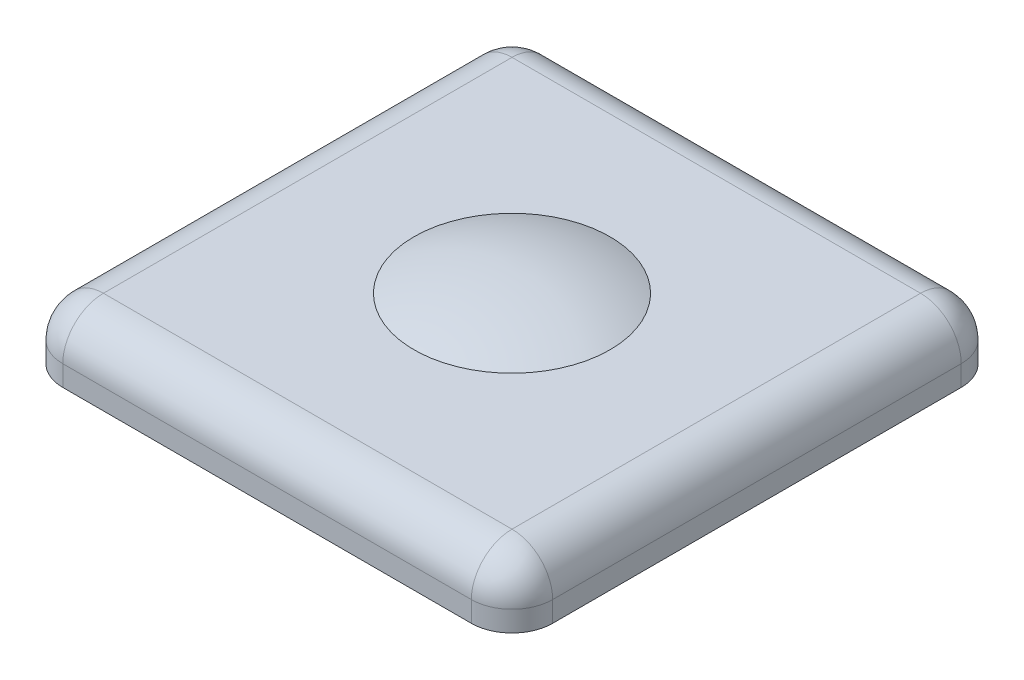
from build123d import *

# Parameters (mm, degrees)
BOSS_EXTRUDE1_START = 5.995416
SKETCH3_W           = 25.4
SKETCH3_H           = 25.4
SKETCH3_R           = 3.2639
BOSS_EXTRUDE1_DEPTH = 3.175
SKETCH4_W           = 6.35
SKETCH4_H           = 2.1082
BOSS_EXTRUDE2_DEPTH = 2.1082
FILLET1_R           = 2.1082
CUT_EXTRUDE1_REACH  = 24.197


with BuildPart() as part:
    # Sketch3 → Boss-Extrude1 (new body)
    with BuildSketch(Plane(origin=(0, 0, 0), x_dir=(1, 0, 0), z_dir=(0, 1, 0)).offset(BOSS_EXTRUDE1_START)):
        Rectangle(SKETCH3_W, SKETCH3_H)
        with Locations(Location((0, 0, 0), (0, 0, 270))):
            Circle(SKETCH3_R, mode=Mode.SUBTRACT)
    extrude(amount=-BOSS_EXTRUDE1_DEPTH)

    # Sketch4 → Boss-Extrude2 (add)
    with BuildSketch(Plane.XZ.offset(-2.820416)):
        with Locations((0, -11.6459)):
            Rectangle(SKETCH4_W, SKETCH4_H)
    extrude(amount=BOSS_EXTRUDE2_DEPTH)

    # Fillet1
    fillet1_edges = [part.edges().sort_by_distance(p)[0] for p in [
        (0, 5.995416, -12.7),
        (12.7, 5.995416, 0),
        (0, 5.995416, 12.7),
        (-12.7, 5.995416, 0),
        (-12.7, 4.407916, -12.7),
        (12.7, 4.407916, -12.7),
        (12.7, 4.407916, 12.7),
        (-12.7, 4.407916, 12.7),
    ]]
    fillet(fillet1_edges, radius=FILLET1_R)


with BuildPart() as body_2:
    # Sketch5 → Revolve1 (revolve)
    with BuildSketch(Plane.XY, mode=Mode.PRIVATE) as revolve1_sk:
        with BuildLine():
            Line((-5.08, 5.995416), (-1.6002, 5.995416))
            Line((-1.6002, 5.995416), (-1.6002, 2.396612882))
            Line((-1.6002, 2.396612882), (-3.048, 2.953531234))
            Line((-3.048, 2.953531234), (-1.6002, 1.421990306))
            Line((-1.6002, 1.421990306), (-1.6002, 0.913990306))
            Line((-1.6002, 0.913990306), (-3.048, 1.470908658))
            Line((-3.048, 1.470908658), (-1.6002, -0.060632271))
            Line((-1.6002, -0.060632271), (-1.6002, -0.568632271))
            Line((-1.6002, -0.568632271), (-3.048, -0.011713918))
            Line((-3.048, -0.011713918), (-1.6002, -1.543254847))
            Line((-1.6002, -1.543254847), (-1.6002, -2.051254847))
            Line((-1.6002, -2.051254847), (-3.048, -1.494336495))
            Line((-3.048, -1.494336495), (-1.6002, -3.025877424))
            Line((-1.6002, -3.025877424), (-1.6002, -3.533877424))
            Line((-1.6002, -3.533877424), (-3.048, -2.976959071))
            Line((-3.048, -2.976959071), (-1.6002, -4.5085))
            Line((-1.6002, -4.5085), (-3.048, -4.5085))
            Line((-3.048, -4.5085), (-1.658882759, -6.0579))
            Line((-1.658882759, -6.0579), (-1.658882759, -6.3881))
            Line((-1.658882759, -6.3881), (-1.785882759, -6.3881))
            Line((-1.785882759, -6.3881), (-1.1938, -7.0485))
            Line((-1.1938, -7.0485), (0, -7.0485))
            Line((0, -7.0485), (0, 7.0485))
            ThreePointArc((0, 7.0485), (-2.59400202, 6.782459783), (-5.08, 5.995416))
        make_face()
    revolve(revolve1_sk.sketch.rotate(Axis((0, -7.0485, 0), (0, 1, 0)), 180), axis=Axis((0, -7.0485, 0), (0, 1, 0)))

    # Cut-Extrude1: up to this face of the body (flat: up to its plane)
    cut_extrude1_end = Plane(body_2.part.faces().sort_by_distance((-1.709395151, -6.3881, 0))[0])
    # Sketch6 → Cut-Extrude1 (cut, up to the picked face)
    with BuildSketch(Plane.XZ.offset(-5.995416), mode=Mode.PRIVATE) as cut_extrude1_sk1:
        with BuildLine():
            Line((1.646319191, 5.08), (-1.646319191, 5.08))
            Line((-1.646319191, 5.08), (-0.635, 1.468814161))
            ThreePointArc((-0.635, 1.468814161), (0, 1.6002), (0.635, 1.468814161))
            Line((0.635, 1.468814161), (1.646319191, 5.08))
        make_face()
    cut_extrude1_tool1 = split(extrude(cut_extrude1_sk1.sketch, amount=CUT_EXTRUDE1_REACH, mode=Mode.PRIVATE), bisect_by=cut_extrude1_end, keep=Keep.BOTH, mode=Mode.PRIVATE)
    add(cut_extrude1_tool1.solids().sort_by(Axis((0, 5.995416, 3.569099), (0, -1, 0)))[0], mode=Mode.SUBTRACT)


solid = Compound([part.part, body_2.part])
